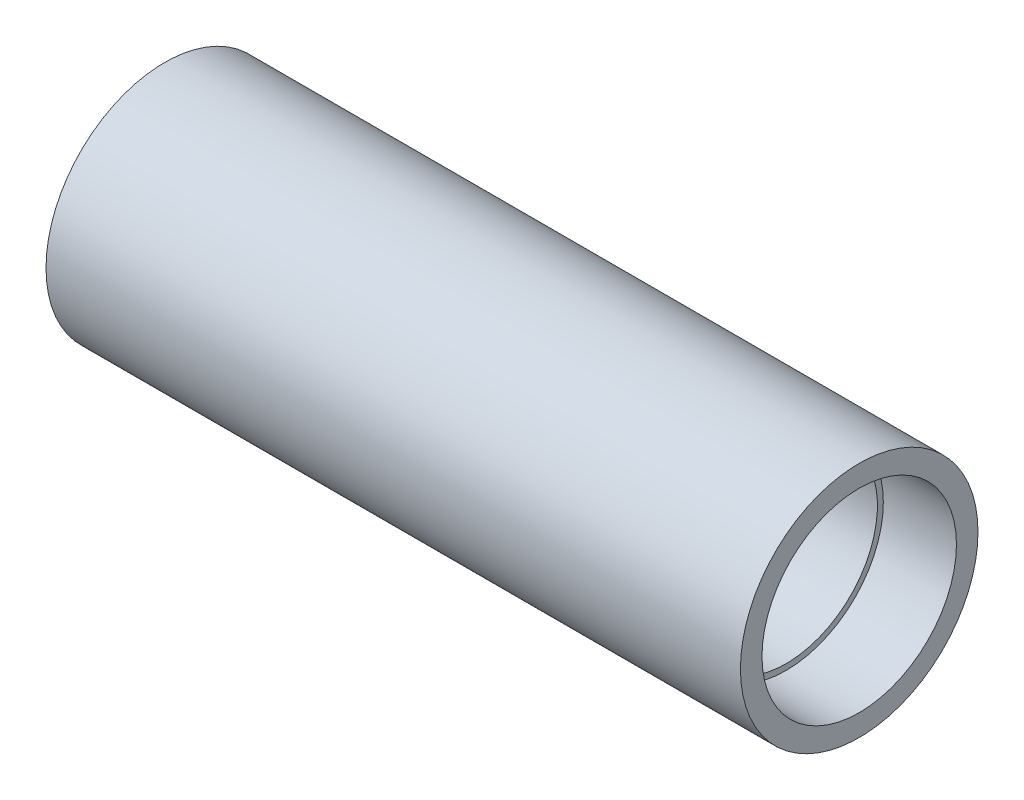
from build123d import *


with BuildPart() as part:
    # Sketch2 → Revolve1 (revolve)
    with BuildSketch(Plane.XY, mode=Mode.PRIVATE) as revolve1_sk:
        Polygon((47.625, 15.8623), (-47.625, 15.8623), (-47.625, 16.891), (-60.325, 16.891), (-60.325, 20.6375), (60.325, 20.6375), (60.325, 16.891), (47.625, 16.891), align=None)
    revolve(revolve1_sk.sketch.rotate(Axis((0, 0, 0), (1, 0, 0)), 90), axis=Axis((0, 0, 0), (1, 0, 0)))


solid = part.part
